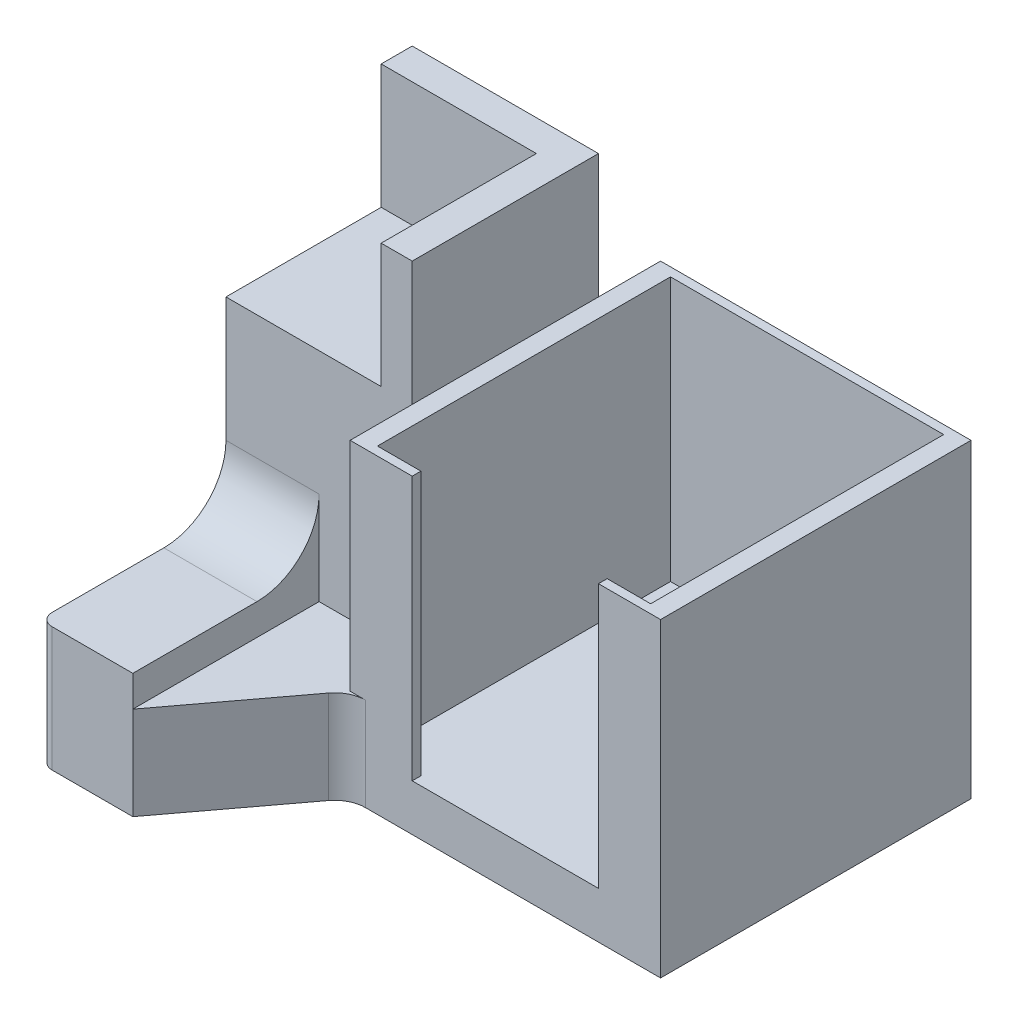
from build123d import *

# Parameters (mm, degrees)
CROQUIS1_W              = 50
CROQUIS1_H              = 50
SALIENTE_EXTRUIR1_DEPTH = 50
CORTAR_EXTRUIR1_DEPTH   = 42.5
CROQUIS5_W              = 30
CROQUIS5_H              = 50
SALIENTE_EXTRUIR3_DEPTH = 30
CROQUIS6_W              = 20
CROQUIS6_H              = 20
CORTAR_EXTRUIR3_DEPTH   = 45
CROQUIS7_W              = 30
CROQUIS7_H              = 15
SALIENTE_EXTRUIR4_DEPTH = 15
CROQUIS8_R              = 4.05
CORTAR_EXTRUIR4_DEPTH   = 10
CROQUIS9_W              = 15
CROQUIS9_H              = 30
SALIENTE_EXTRUIR5_DEPTH = 5
REDONDEO2_R             = 10
REDONDEO3_R             = 2
SALIENTE_EXTRUIR6_START = -5
SALIENTE_EXTRUIR6_DEPTH = 15
REDONDEO4_R             = 5
SALIENTE_EXTRUIR7_DEPTH = 20


with BuildPart() as part:
    # Croquis1 → Saliente-Extruir1 (new body)
    with BuildSketch(Plane.XY):
        Rectangle(CROQUIS1_W, CROQUIS1_H)
    extrude(amount=SALIENTE_EXTRUIR1_DEPTH)

    # Croquis2 → Cortar-Extruir1 (cut)
    with BuildSketch(Plane(origin=(0, 25, 0), x_dir=(1, 0, 0), z_dir=(0, 1, 0))):
        Polygon((-22, -48.6), (-15, -48.6), (-15, -50), (15, -50), (15, -48.6), (22, -48.6), (22, -1.4), (-22, -1.4), align=None)
    extrude(amount=-CORTAR_EXTRUIR1_DEPTH, mode=Mode.SUBTRACT)

    # Croquis5 → Saliente-Extruir3 (add)
    with BuildSketch(Plane.ZY.offset(25)):
        with Locations((25, 0)):
            Rectangle(CROQUIS5_W, CROQUIS5_H)
    extrude(amount=SALIENTE_EXTRUIR3_DEPTH)

    # Croquis6 → Cortar-Extruir3 (cut)
    with BuildSketch(Plane.XZ.offset(25)):
        with Locations((-40, 25)):
            Rectangle(CROQUIS6_W, CROQUIS6_H)
    extrude(amount=-CORTAR_EXTRUIR3_DEPTH, mode=Mode.SUBTRACT)

    # Croquis7 → Saliente-Extruir4 (add)
    with BuildSketch(Plane.ZY.offset(55)):
        with Locations((55, -17.5)):
            Rectangle(CROQUIS7_W, CROQUIS7_H)
    extrude(amount=-SALIENTE_EXTRUIR4_DEPTH)

    # Croquis8 → Cortar-Extruir4 (cut)
    with BuildSketch(Plane.ZY.offset(55)):
        with Locations((62.2, -15)):
            Circle(CROQUIS8_R)
    extrude(amount=-CORTAR_EXTRUIR4_DEPTH, mode=Mode.SUBTRACT)

    # Croquis9 → Saliente-Extruir5 (add)
    with BuildSketch(Plane(origin=(0, -10, 0), x_dir=(1, 0, 0), z_dir=(0, 1, 0))):
        with Locations((-47.5, -55)):
            Rectangle(CROQUIS9_W, CROQUIS9_H)
    extrude(amount=SALIENTE_EXTRUIR5_DEPTH)

    # Redondeo2
    redondeo2_edges = [part.edges().sort_by_distance(p)[0] for p in [
        (-47.5, -5, 40),
    ]]
    fillet(redondeo2_edges, radius=REDONDEO2_R)

    # Redondeo3
    redondeo3_edges = [part.edges().sort_by_distance(p)[0] for p in [
        (-55, -15, 70),
    ]]
    fillet(redondeo3_edges, radius=REDONDEO3_R)

    # Croquis10 → Saliente-Extruir6 (add)
    with BuildSketch(Plane(origin=(0, -5, 0), x_dir=(1, 0, 0), z_dir=(0, 1, 0)).offset(SALIENTE_EXTRUIR6_START)):
        Polygon((-40, -70), (-25, -50), (-25, -40), (-40, -40), align=None)
    extrude(amount=-SALIENTE_EXTRUIR6_DEPTH)

    # Redondeo4
    redondeo4_edges = [part.edges().sort_by_distance(p)[0] for p in [
        (-25, -17.5, 50),
    ]]
    fillet(redondeo4_edges, radius=REDONDEO4_R)

    # Croquis11 → Saliente-Extruir7 (add)
    with BuildSketch(Plane(origin=(0, 25, 0), x_dir=(1, 0, 0), z_dir=(0, 1, 0))):
        Polygon((-25, -10), (-25, -40), (-30, -40), (-30, -15), (-55, -15), (-55, -10), align=None)
    extrude(amount=SALIENTE_EXTRUIR7_DEPTH)


solid = part.part
